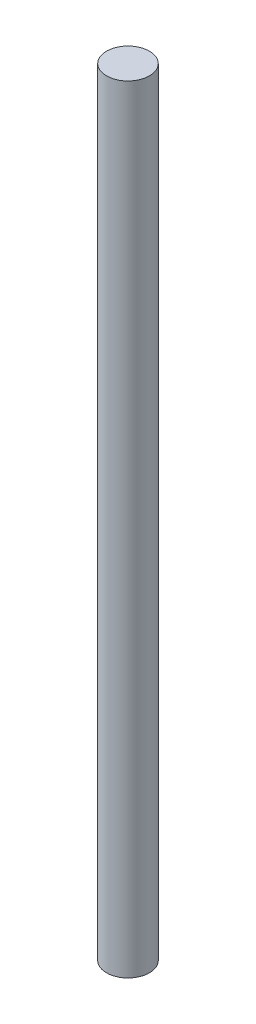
from build123d import *

# Parameters (mm, degrees)
SKETCH1_R           = 4
BOSS_EXTRUDE1_DEPTH = 72.5


with BuildPart() as part:
    # Sketch1 → Boss-Extrude1 (new, symmetric)
    with BuildSketch(Plane(origin=(0, 0, 0), x_dir=(1, 0, 0), z_dir=(0, 1, 0))):
        with Locations(Location((0, 0, 0), (0, 0, 270))):
            Circle(SKETCH1_R)
    extrude(amount=BOSS_EXTRUDE1_DEPTH, both=True)


solid = part.part
